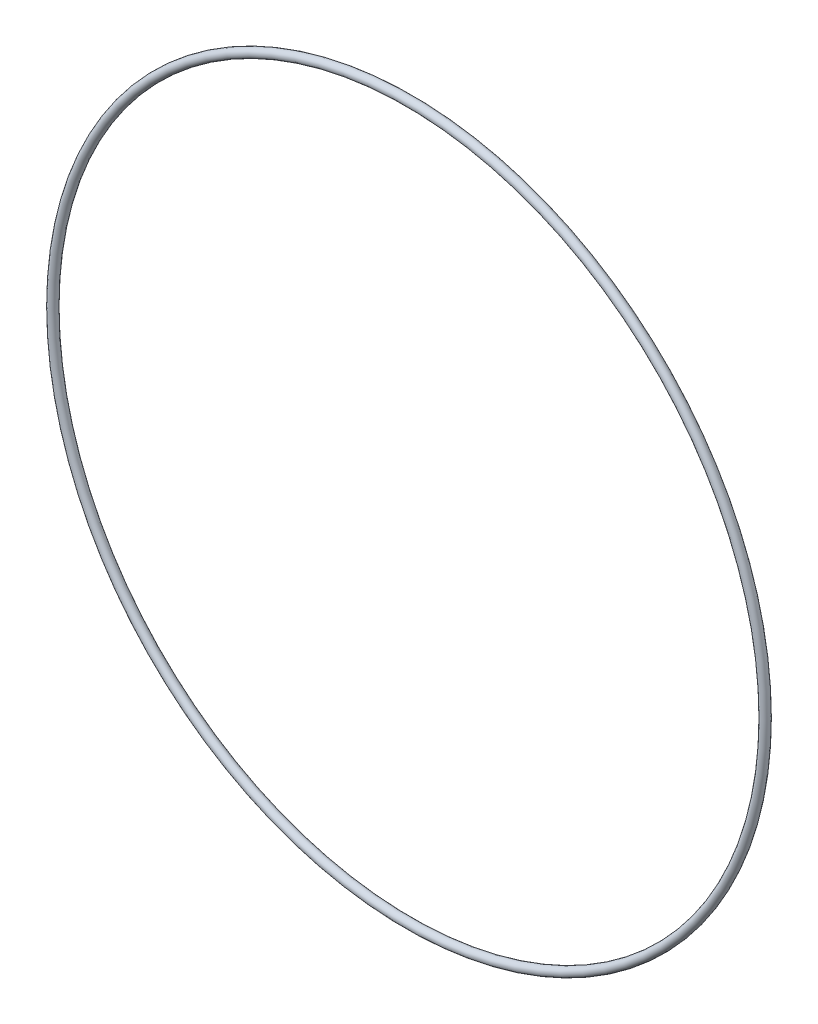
ISO-10303-21;
HEADER;
FILE_DESCRIPTION(('STEP AP214'),'2;1');
FILE_NAME('part.step','',(''),(''),'','','');
FILE_SCHEMA(('AUTOMOTIVE_DESIGN { 1 0 10303 214 1 1 1 1 }'));
ENDSEC;
DATA;
#1=APPLICATION_CONTEXT('core data for automotive mechanical design processes');
#2=APPLICATION_PROTOCOL_DEFINITION('international standard','automotive_design',2000,#1);
#3=PRODUCT_CONTEXT('',#1,'mechanical');
#4=PRODUCT('Part','Part','',(#3));
#5=PRODUCT_RELATED_PRODUCT_CATEGORY('part','',(#4));
#6=PRODUCT_DEFINITION_FORMATION('','',#4);
#7=PRODUCT_DEFINITION_CONTEXT('part definition',#1,'design');
#8=PRODUCT_DEFINITION('design','',#6,#7);
#9=PRODUCT_DEFINITION_SHAPE('','',#8);
#10=(LENGTH_UNIT() NAMED_UNIT(*) SI_UNIT(.MILLI.,.METRE.));
#11=(NAMED_UNIT(*) PLANE_ANGLE_UNIT() SI_UNIT($,.RADIAN.));
#12=(NAMED_UNIT(*) SI_UNIT($,.STERADIAN.) SOLID_ANGLE_UNIT());
#13=UNCERTAINTY_MEASURE_WITH_UNIT(LENGTH_MEASURE(1.E-05),#10,'distance_accuracy_value','');
#14=(GEOMETRIC_REPRESENTATION_CONTEXT(3) GLOBAL_UNCERTAINTY_ASSIGNED_CONTEXT((#13)) GLOBAL_UNIT_ASSIGNED_CONTEXT((#10,
#11,#12)) REPRESENTATION_CONTEXT('',''));
#15=CARTESIAN_POINT('',(0.,0.,0.));
#16=DIRECTION('',(0.,0.,1.));
#17=DIRECTION('',(1.,0.,0.));
#18=AXIS2_PLACEMENT_3D('',#15,#16,#17);
#19=CARTESIAN_POINT('',(0.,0.,0.));
#20=DIRECTION('',(0.,0.,1.));
#21=DIRECTION('',(1.,0.,0.));
#22=AXIS2_PLACEMENT_3D('',#19,#20,#21);
#23=TOROIDAL_SURFACE('',#22,105.918,1.30810000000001);
#24=CARTESIAN_POINT('',(107.2261,0.,0.));
#25=VERTEX_POINT('',#24);
#26=VERTEX_LOOP('',#25);
#27=FACE_BOUND('',#26,.T.);
#28=ADVANCED_FACE('F35',(#27),#23,.T.);
#29=CLOSED_SHELL('',(#28));
#30=MANIFOLD_SOLID_BREP('B2',#29);
#31=ADVANCED_BREP_SHAPE_REPRESENTATION('',(#18,#30),#14);
#32=SHAPE_DEFINITION_REPRESENTATION(#9,#31);
ENDSEC;
END-ISO-10303-21;
